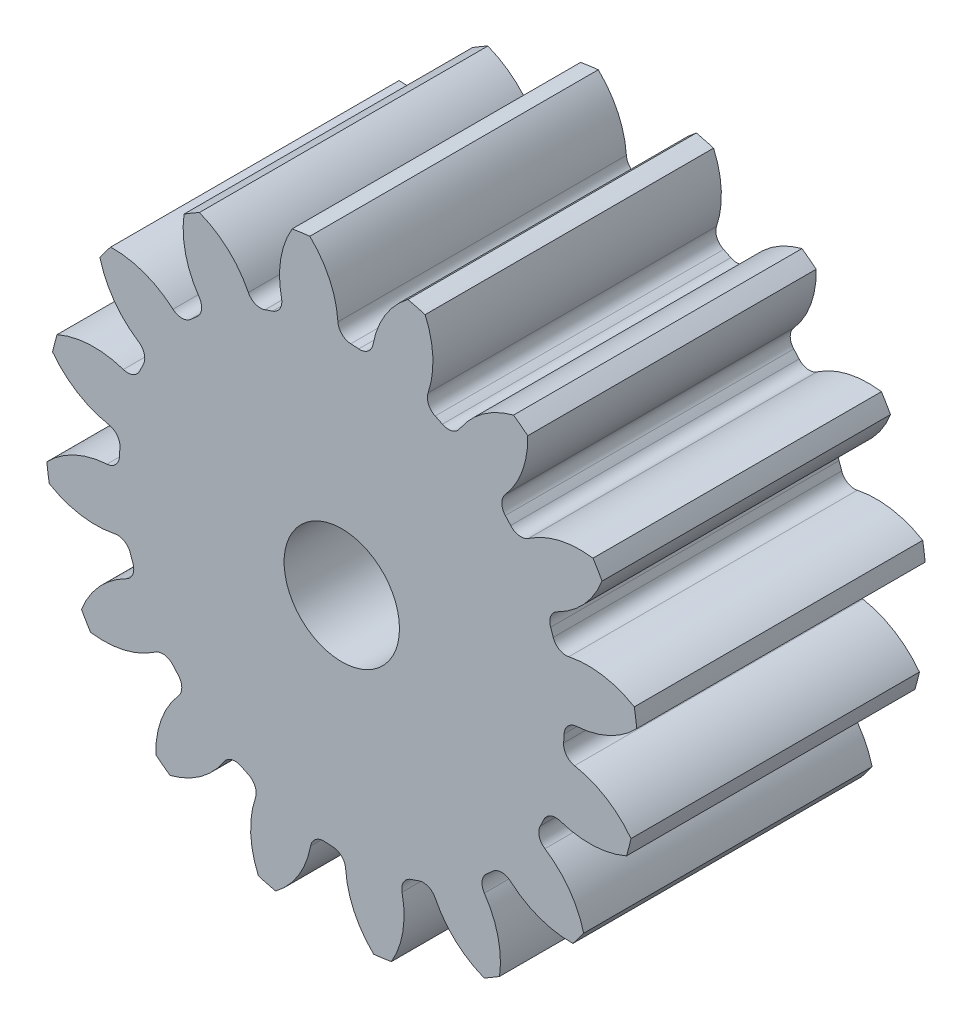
from build123d import *

# Parameters (mm, degrees)
SKETCH3_R         = 91.44
GEARBODY_DEPTH    = 88.9
TOOTHCUT_DEPTH    = 157.925960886
CIRPATTERN1_COUNT = 16
BOREDIA_R         = 17.78
BORE_DEPTH        = 12700


with BuildPart() as part:
    # Sketch3 → gearBody (new body)
    with BuildSketch(Plane.XY):
        Circle(SKETCH3_R)
    extrude(amount=GEARBODY_DEPTH)

    # Sketch2 → toothCut (cut, through all)
    with BuildSketch(Plane.XY):
        with BuildLine():
            ThreePointArc((68.380000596, -5.233728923), (68.463025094, -4.003822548), (68.523929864, -2.772622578))
            ThreePointArc((68.523929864, -2.772622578), (69.696124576, -0.051841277), (72.38739514, 1.186606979))
            ThreePointArc((72.38739514, 1.186606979), (82.816158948, 3.938902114), (91.44, 10.416834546))
            ThreePointArc((91.44, 10.416834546), (91.874454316, -5.37295878), (89.6024338, -21.004473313))
            ThreePointArc((89.6024338, -21.004473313), (81.792476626, -13.565467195), (71.755623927, -9.616311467))
            ThreePointArc((71.755623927, -9.616311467), (69.22705837, -8.072599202), (68.380000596, -5.233728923))
        make_face()
    toothcut = extrude(amount=TOOTHCUT_DEPTH, mode=Mode.SUBTRACT)

    # CirPattern1: toothCut ×16 about axis
    cirpattern1_axis = Axis((0, 0, 0), (0, 0, 1))
    for i in range(1, CIRPATTERN1_COUNT):
        add(toothcut.rotate(cirpattern1_axis, i * 360 / CIRPATTERN1_COUNT), mode=Mode.SUBTRACT)

    # boreDia → bore (cut, symmetric)
    with BuildSketch(Plane.XY):
        Circle(BOREDIA_R)
    extrude(amount=BORE_DEPTH, both=True, mode=Mode.SUBTRACT)


solid = part.part
